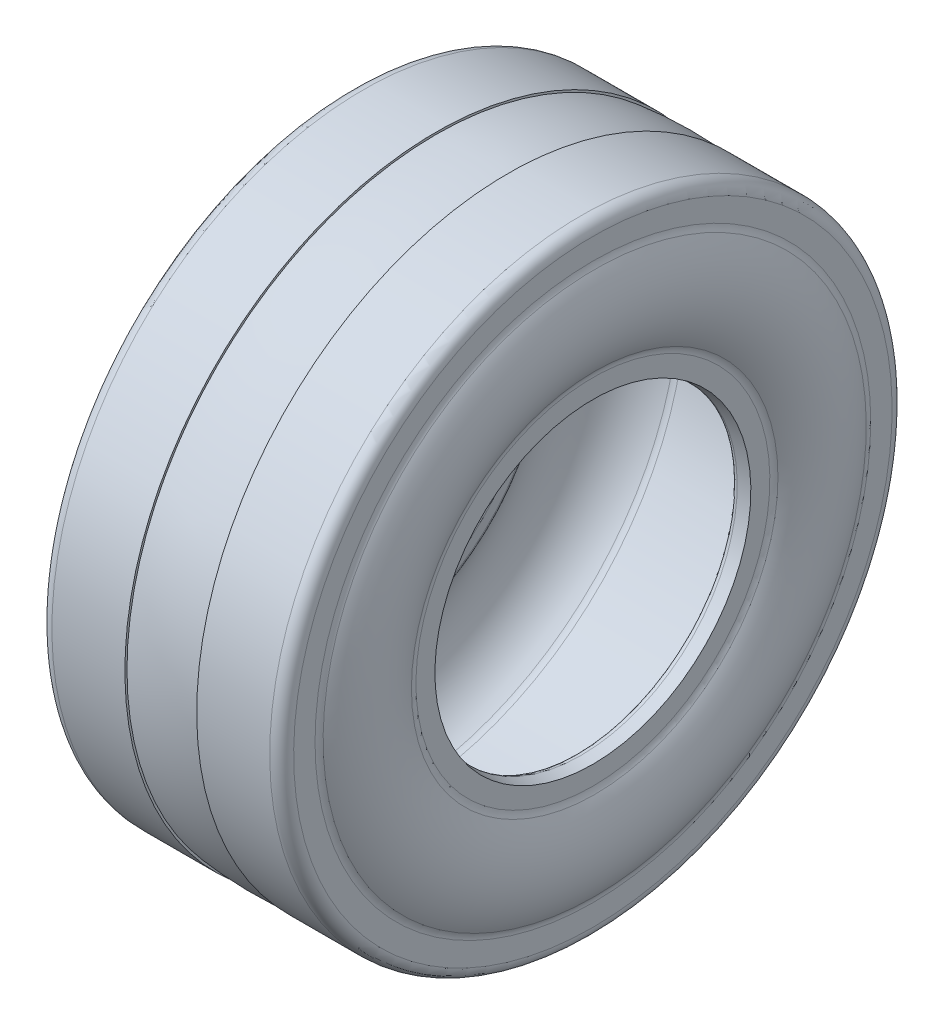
from build123d import *


with BuildPart() as part:
    # Esquisse1 → Base-R_volution (revolve)
    with BuildSketch(Plane(origin=(80, -50, 0), x_dir=(1, 0, 0), z_dir=(0, 0, 1)), mode=Mode.PRIVATE) as base_r_volution_sk:
        with BuildLine():
            Line((-67.645855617, 16.479297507), (-37.145855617, 16.479297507))
            Line((-37.145855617, 16.479297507), (-37.145855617, 15.611013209))
            ThreePointArc((-37.145855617, 15.611013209), (-22.145855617, 16.479297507), (-7.145855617, 15.611013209))
            Line((-7.145855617, 15.611013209), (-7.145855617, 16.479297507))
            Line((-7.145855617, 16.479297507), (23.354144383, 16.479297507))
            ThreePointArc((23.354144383, 16.479297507), (26.889678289, 15.014831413), (28.354144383, 11.479297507))
            Line((28.354144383, 11.479297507), (28.354144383, 2.550605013))
            ThreePointArc((28.354144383, 2.550605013), (28.545298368, 1.181298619), (29.104144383, -0.083308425))
            ThreePointArc((29.104144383, -0.083308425), (34.354144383, -18.520702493), (29.104144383, -36.95809656))
            ThreePointArc((29.104144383, -36.95809656), (28.545298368, -38.222703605), (28.354144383, -39.592009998))
            Line((28.354144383, -39.592009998), (28.354144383, -47.520702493))
            Line((28.354144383, -47.520702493), (23.434214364, -48.302143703))
            ThreePointArc((23.434214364, -48.302143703), (21.647193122, -47.679462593), (21.179200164, -45.845843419))
            Line((21.179200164, -45.845843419), (22.704277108, -39.691508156))
            ThreePointArc((22.704277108, -39.691508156), (23.070086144, -38.688881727), (23.640354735, -37.786734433))
            ThreePointArc((23.640354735, -37.786734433), (29.689061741, -12.133779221), (13.810106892, 8.902374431))
            ThreePointArc((13.810106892, 8.902374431), (12.679461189, 9.332924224), (11.478500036, 9.479297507))
            Line((11.478500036, 9.479297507), (-55.77021127, 9.479297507))
            ThreePointArc((-55.77021127, 9.479297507), (-56.971172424, 9.332924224), (-58.101818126, 8.902374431))
            ThreePointArc((-58.101818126, 8.902374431), (-73.980772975, -12.133779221), (-67.93206597, -37.786734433))
            ThreePointArc((-67.93206597, -37.786734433), (-67.361797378, -38.688881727), (-66.995988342, -39.691508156))
            Line((-66.995988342, -39.691508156), (-65.470911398, -45.845843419))
            ThreePointArc((-65.470911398, -45.845843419), (-65.938904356, -47.679462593), (-67.725925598, -48.302143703))
            Line((-67.725925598, -48.302143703), (-72.645855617, -47.520702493))
            Line((-72.645855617, -47.520702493), (-72.645855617, -39.592009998))
            ThreePointArc((-72.645855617, -39.592009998), (-72.837009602, -38.222703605), (-73.395855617, -36.95809656))
            ThreePointArc((-73.395855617, -36.95809656), (-78.645855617, -18.520702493), (-73.395855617, -0.083308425))
            ThreePointArc((-73.395855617, -0.083308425), (-72.837009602, 1.181298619), (-72.645855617, 2.550605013))
            Line((-72.645855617, 2.550605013), (-72.645855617, 11.479297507))
            ThreePointArc((-72.645855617, 11.479297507), (-71.181389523, 15.014831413), (-67.645855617, 16.479297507))
        make_face()
    revolve(base_r_volution_sk.sketch.rotate(Axis((0, -163.520702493, 0), (1, 0, 0)), 180), axis=Axis((0, -163.520702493, 0), (1, 0, 0)))


solid = part.part
